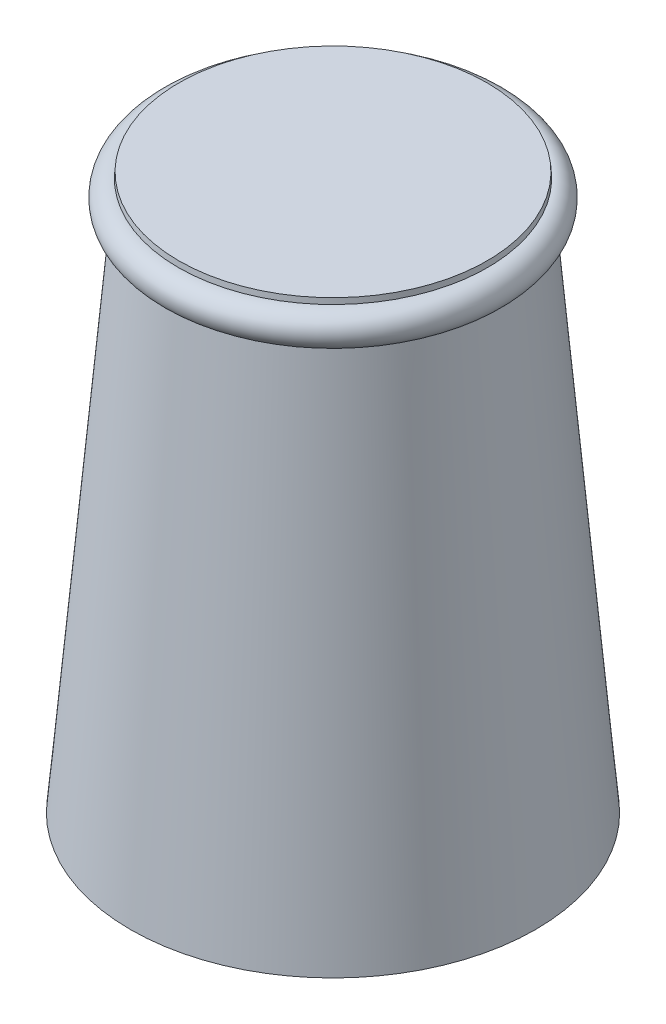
from build123d import *

# Parameters (mm, degrees)
SKIZZE1_R               = 18.265029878
LINEAR_AUSTRAGEN1_DEPTH = 50
LINEAR_AUSTRAGEN1_TAPER = 5


with BuildPart() as part:
    # Skizze1 → Linear austragen1 (new body)
    with BuildSketch(Plane(origin=(0, 0, 0), x_dir=(1, 0, 0), z_dir=(0, 1, 0))):
        Circle(SKIZZE1_R)
    extrude(amount=LINEAR_AUSTRAGEN1_DEPTH, taper=LINEAR_AUSTRAGEN1_TAPER)

    # Skizze2 → Rotation2 (revolve)
    with BuildSketch(Plane.XY, mode=Mode.PRIVATE) as rotation2_sk:
        with BuildLine():
            Line((14.196307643, 46.505707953), (13.934840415, 49.494292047))
            ThreePointArc((13.934840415, 49.494292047), (15.559866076, 48.130733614), (14.196307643, 46.505707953))
        make_face()
    revolve(rotation2_sk.sketch.rotate(Axis((0, 0, 0), (0, -1, 0)), 90), axis=Axis((0, 0, 0), (0, -1, 0)))


solid = part.part
